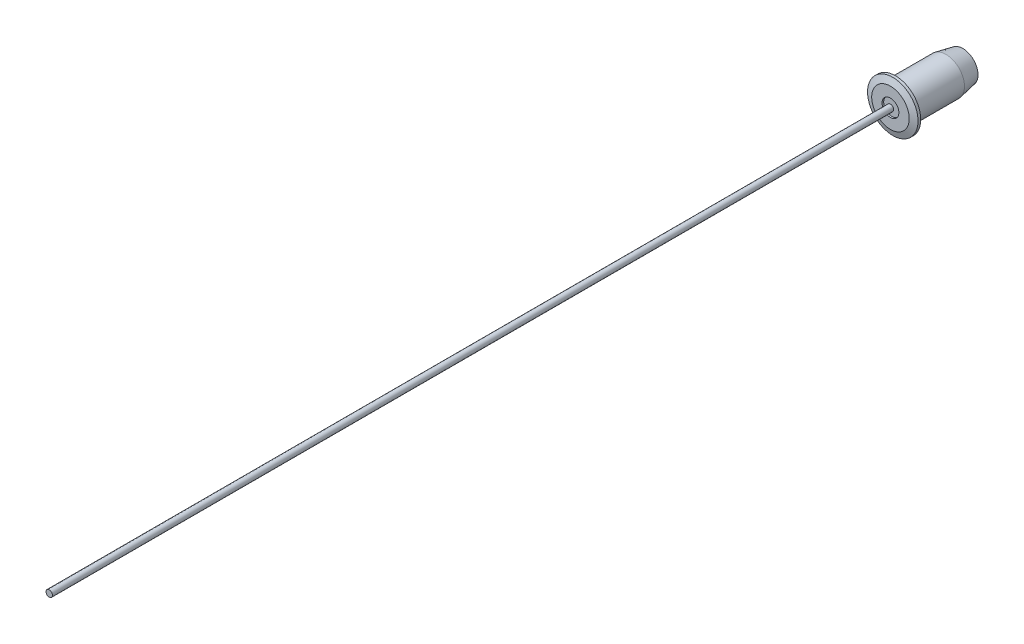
ISO-10303-21;
HEADER;
FILE_DESCRIPTION(('STEP AP214'),'2;1');
FILE_NAME('part.step','',(''),(''),'','','');
FILE_SCHEMA(('AUTOMOTIVE_DESIGN { 1 0 10303 214 1 1 1 1 }'));
ENDSEC;
DATA;
#1=APPLICATION_CONTEXT('core data for automotive mechanical design processes');
#2=APPLICATION_PROTOCOL_DEFINITION('international standard','automotive_design',2000,#1);
#3=PRODUCT_CONTEXT('',#1,'mechanical');
#4=PRODUCT('Part','Part','',(#3));
#5=PRODUCT_RELATED_PRODUCT_CATEGORY('part','',(#4));
#6=PRODUCT_DEFINITION_FORMATION('','',#4);
#7=PRODUCT_DEFINITION_CONTEXT('part definition',#1,'design');
#8=PRODUCT_DEFINITION('design','',#6,#7);
#9=PRODUCT_DEFINITION_SHAPE('','',#8);
#10=(LENGTH_UNIT() NAMED_UNIT(*) SI_UNIT(.MILLI.,.METRE.));
#11=(NAMED_UNIT(*) PLANE_ANGLE_UNIT() SI_UNIT($,.RADIAN.));
#12=(NAMED_UNIT(*) SI_UNIT($,.STERADIAN.) SOLID_ANGLE_UNIT());
#13=UNCERTAINTY_MEASURE_WITH_UNIT(LENGTH_MEASURE(1.E-05),#10,'distance_accuracy_value','');
#14=(GEOMETRIC_REPRESENTATION_CONTEXT(3) GLOBAL_UNCERTAINTY_ASSIGNED_CONTEXT((#13)) GLOBAL_UNIT_ASSIGNED_CONTEXT((#10,
#11,#12)) REPRESENTATION_CONTEXT('',''));
#15=CARTESIAN_POINT('',(0.,0.,0.));
#16=DIRECTION('',(0.,0.,1.));
#17=DIRECTION('',(1.,0.,0.));
#18=AXIS2_PLACEMENT_3D('',#15,#16,#17);
#19=CARTESIAN_POINT('',(0.,0.,251.5));
#20=DIRECTION('',(0.,0.,-1.));
#21=DIRECTION('',(-1.,0.,0.));
#22=AXIS2_PLACEMENT_3D('',#19,#20,#21);
#23=CYLINDRICAL_SURFACE('',#22,0.954691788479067);
#24=CARTESIAN_POINT('',(0.,0.,251.5));
#25=DIRECTION('',(0.,0.,1.));
#26=DIRECTION('',(1.,0.,0.));
#27=AXIS2_PLACEMENT_3D('',#24,#25,#26);
#28=CIRCLE('',#27,0.954691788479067);
#29=CARTESIAN_POINT('',(0.954691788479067,0.,251.5));
#30=VERTEX_POINT('',#29);
#31=EDGE_CURVE('E11',#30,#30,#28,.T.);
#32=ORIENTED_EDGE('',*,*,#31,.F.);
#33=EDGE_LOOP('',(#32));
#34=FACE_BOUND('',#33,.T.);
#35=CARTESIAN_POINT('',(0.,0.,1.5));
#36=DIRECTION('',(0.,0.,1.));
#37=DIRECTION('',(1.,0.,0.));
#38=AXIS2_PLACEMENT_3D('',#35,#36,#37);
#39=CIRCLE('',#38,0.954691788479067);
#40=CARTESIAN_POINT('',(0.954691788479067,0.,1.5));
#41=VERTEX_POINT('',#40);
#42=EDGE_CURVE('E44',#41,#41,#39,.T.);
#43=ORIENTED_EDGE('',*,*,#42,.T.);
#44=EDGE_LOOP('',(#43));
#45=FACE_BOUND('',#44,.T.);
#46=ADVANCED_FACE('F41',(#34,#45),#23,.T.);
#47=CARTESIAN_POINT('',(0.,0.,251.5));
#48=DIRECTION('',(0.,0.,1.));
#49=DIRECTION('',(1.,0.,0.));
#50=AXIS2_PLACEMENT_3D('',#47,#48,#49);
#51=PLANE('',#50);
#52=ORIENTED_EDGE('',*,*,#31,.T.);
#53=EDGE_LOOP('',(#52));
#54=FACE_BOUND('',#53,.T.);
#55=ADVANCED_FACE('F56',(#54),#51,.T.);
#56=CARTESIAN_POINT('',(0.,0.,1.5));
#57=DIRECTION('',(0.,0.,1.));
#58=DIRECTION('',(1.,0.,0.));
#59=AXIS2_PLACEMENT_3D('',#56,#57,#58);
#60=PLANE('',#59);
#61=ORIENTED_EDGE('',*,*,#42,.F.);
#62=EDGE_LOOP('',(#61));
#63=FACE_BOUND('',#62,.T.);
#64=ADVANCED_FACE('F54',(#63),#60,.F.);
#65=CLOSED_SHELL('',(#46,#55,#64));
#66=MANIFOLD_SOLID_BREP('B2_NOT_SHOWN',#65);
#67=CARTESIAN_POINT('',(0.,0.,1.5));
#68=DIRECTION('',(0.,0.,-1.));
#69=DIRECTION('',(-1.,0.,0.));
#70=AXIS2_PLACEMENT_3D('',#67,#68,#69);
#71=CYLINDRICAL_SURFACE('',#70,7.5);
#72=CARTESIAN_POINT('',(0.,0.,0.800000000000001));
#73=DIRECTION('',(0.,0.,1.));
#74=DIRECTION('',(1.,0.,0.));
#75=AXIS2_PLACEMENT_3D('',#72,#73,#74);
#76=CIRCLE('',#75,7.5);
#77=CARTESIAN_POINT('',(-7.5,0.,0.800000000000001));
#78=VERTEX_POINT('',#77);
#79=EDGE_CURVE('E96',#78,#78,#76,.F.);
#80=ORIENTED_EDGE('',*,*,#79,.T.);
#81=EDGE_LOOP('',(#80));
#82=FACE_BOUND('',#81,.T.);
#83=CARTESIAN_POINT('',(0.,0.,0.));
#84=DIRECTION('',(0.,0.,1.));
#85=DIRECTION('',(1.,0.,0.));
#86=AXIS2_PLACEMENT_3D('',#83,#84,#85);
#87=CIRCLE('',#86,7.5);
#88=CARTESIAN_POINT('',(7.5,0.,0.));
#89=VERTEX_POINT('',#88);
#90=EDGE_CURVE('E104',#89,#89,#87,.T.);
#91=ORIENTED_EDGE('',*,*,#90,.T.);
#92=EDGE_LOOP('',(#91));
#93=FACE_BOUND('',#92,.T.);
#94=ADVANCED_FACE('F81',(#82,#93),#71,.T.);
#95=CARTESIAN_POINT('',(0.,0.,1.5));
#96=DIRECTION('',(0.,0.,1.));
#97=DIRECTION('',(1.,0.,0.));
#98=AXIS2_PLACEMENT_3D('',#95,#96,#97);
#99=PLANE('',#98);
#100=CARTESIAN_POINT('',(0.,0.,1.5));
#101=DIRECTION('',(0.,0.,1.));
#102=DIRECTION('',(1.,0.,0.));
#103=AXIS2_PLACEMENT_3D('',#100,#101,#102);
#104=CIRCLE('',#103,2.5);
#105=CARTESIAN_POINT('',(2.5,0.,1.5));
#106=VERTEX_POINT('',#105);
#107=EDGE_CURVE('E108',#106,#106,#104,.T.);
#108=ORIENTED_EDGE('',*,*,#107,.F.);
#109=EDGE_LOOP('',(#108));
#110=FACE_BOUND('',#109,.T.);
#111=CARTESIAN_POINT('',(0.,0.,1.5));
#112=DIRECTION('',(0.,0.,1.));
#113=DIRECTION('',(1.,0.,0.));
#114=AXIS2_PLACEMENT_3D('',#111,#112,#113);
#115=CIRCLE('',#114,5.57676580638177);
#116=CARTESIAN_POINT('',(-5.57676580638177,0.,1.5));
#117=VERTEX_POINT('',#116);
#118=EDGE_CURVE('E101',#117,#117,#115,.T.);
#119=ORIENTED_EDGE('',*,*,#118,.T.);
#120=EDGE_LOOP('',(#119));
#121=FACE_BOUND('',#120,.T.);
#122=ADVANCED_FACE('F122',(#110,#121),#99,.T.);
#123=CARTESIAN_POINT('',(0.,0.,0.));
#124=DIRECTION('',(0.,0.,1.));
#125=DIRECTION('',(1.,0.,0.));
#126=AXIS2_PLACEMENT_3D('',#123,#124,#125);
#127=PLANE('',#126);
#128=CARTESIAN_POINT('',(0.,0.,0.));
#129=DIRECTION('',(0.,0.,1.));
#130=DIRECTION('',(1.,0.,0.));
#131=AXIS2_PLACEMENT_3D('',#128,#129,#130);
#132=CIRCLE('',#131,5.5);
#133=CARTESIAN_POINT('',(5.5,0.,0.));
#134=VERTEX_POINT('',#133);
#135=EDGE_CURVE('E92',#134,#134,#132,.F.);
#136=ORIENTED_EDGE('',*,*,#135,.F.);
#137=EDGE_LOOP('',(#136));
#138=FACE_BOUND('',#137,.T.);
#139=ORIENTED_EDGE('',*,*,#90,.F.);
#140=EDGE_LOOP('',(#139));
#141=FACE_BOUND('',#140,.T.);
#142=ADVANCED_FACE('F125',(#138,#141),#127,.F.);
#143=CARTESIAN_POINT('',(0.,0.,1.5));
#144=DIRECTION('',(0.,0.,-1.));
#145=DIRECTION('',(-1.,0.,0.));
#146=AXIS2_PLACEMENT_3D('',#143,#144,#145);
#147=CONICAL_SURFACE('',#146,5.57676580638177,1.22173047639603);
#148=CARTESIAN_POINT('',(-7.5,0.,0.800000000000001));
#149=CARTESIAN_POINT('',(-7.47996631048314,0.,0.807291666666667));
#150=CARTESIAN_POINT('',(-7.45993262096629,0.,0.814583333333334));
#151=CARTESIAN_POINT('',(-7.41986524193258,0.,0.829166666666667));
#152=CARTESIAN_POINT('',(-7.39983155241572,0.,0.836458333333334));
#153=CARTESIAN_POINT('',(-7.359764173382,0.,0.851041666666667));
#154=CARTESIAN_POINT('',(-7.33973048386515,0.,0.858333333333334));
#155=CARTESIAN_POINT('',(-7.29966310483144,0.,0.872916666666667));
#156=CARTESIAN_POINT('',(-7.27962941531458,0.,0.880208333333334));
#157=CARTESIAN_POINT('',(-7.23956203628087,0.,0.894791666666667));
#158=CARTESIAN_POINT('',(-7.21952834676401,0.,0.902083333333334));
#159=CARTESIAN_POINT('',(-7.1794609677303,0.,0.916666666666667));
#160=CARTESIAN_POINT('',(-7.15942727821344,0.,0.923958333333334));
#161=CARTESIAN_POINT('',(-7.11935989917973,0.,0.938541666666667));
#162=CARTESIAN_POINT('',(-7.09932620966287,0.,0.945833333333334));
#163=CARTESIAN_POINT('',(-7.05925883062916,0.,0.960416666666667));
#164=CARTESIAN_POINT('',(-7.0392251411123,0.,0.967708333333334));
#165=CARTESIAN_POINT('',(-6.99915776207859,0.,0.982291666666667));
#166=CARTESIAN_POINT('',(-6.97912407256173,0.,0.989583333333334));
#167=CARTESIAN_POINT('',(-6.93905669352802,0.,1.00416666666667));
#168=CARTESIAN_POINT('',(-6.91902300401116,0.,1.01145833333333));
#169=CARTESIAN_POINT('',(-6.87895562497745,0.,1.02604166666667));
#170=CARTESIAN_POINT('',(-6.85892193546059,0.,1.03333333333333));
#171=CARTESIAN_POINT('',(-6.81885455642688,0.,1.04791666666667));
#172=CARTESIAN_POINT('',(-6.79882086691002,0.,1.05520833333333));
#173=CARTESIAN_POINT('',(-6.75875348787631,0.,1.06979166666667));
#174=CARTESIAN_POINT('',(-6.73871979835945,0.,1.07708333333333));
#175=CARTESIAN_POINT('',(-6.69865241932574,0.,1.09166666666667));
#176=CARTESIAN_POINT('',(-6.67861872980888,0.,1.09895833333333));
#177=CARTESIAN_POINT('',(-6.63855135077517,0.,1.11354166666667));
#178=CARTESIAN_POINT('',(-6.61851766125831,0.,1.12083333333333));
#179=CARTESIAN_POINT('',(-6.5784502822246,0.,1.13541666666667));
#180=CARTESIAN_POINT('',(-6.55841659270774,0.,1.14270833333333));
#181=CARTESIAN_POINT('',(-6.51834921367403,0.,1.15729166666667));
#182=CARTESIAN_POINT('',(-6.49831552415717,0.,1.16458333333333));
#183=CARTESIAN_POINT('',(-6.45824814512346,0.,1.17916666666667));
#184=CARTESIAN_POINT('',(-6.43821445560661,0.,1.18645833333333));
#185=CARTESIAN_POINT('',(-6.39814707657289,0.,1.20104166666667));
#186=CARTESIAN_POINT('',(-6.37811338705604,0.,1.20833333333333));
#187=CARTESIAN_POINT('',(-6.33804600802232,0.,1.22291666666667));
#188=CARTESIAN_POINT('',(-6.31801231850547,0.,1.23020833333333));
#189=CARTESIAN_POINT('',(-6.27794493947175,0.,1.24479166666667));
#190=CARTESIAN_POINT('',(-6.2579112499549,0.,1.25208333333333));
#191=CARTESIAN_POINT('',(-6.21784387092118,0.,1.26666666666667));
#192=CARTESIAN_POINT('',(-6.19781018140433,0.,1.27395833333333));
#193=CARTESIAN_POINT('',(-6.15774280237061,0.,1.28854166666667));
#194=CARTESIAN_POINT('',(-6.13770911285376,0.,1.29583333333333));
#195=CARTESIAN_POINT('',(-6.09764173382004,0.,1.31041666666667));
#196=CARTESIAN_POINT('',(-6.07760804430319,0.,1.31770833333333));
#197=CARTESIAN_POINT('',(-6.03754066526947,0.,1.33229166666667));
#198=CARTESIAN_POINT('',(-6.01750697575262,0.,1.33958333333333));
#199=CARTESIAN_POINT('',(-5.9774395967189,0.,1.35416666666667));
#200=CARTESIAN_POINT('',(-5.95740590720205,0.,1.36145833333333));
#201=CARTESIAN_POINT('',(-5.91733852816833,0.,1.37604166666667));
#202=CARTESIAN_POINT('',(-5.89730483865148,0.,1.38333333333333));
#203=CARTESIAN_POINT('',(-5.85723745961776,0.,1.39791666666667));
#204=CARTESIAN_POINT('',(-5.83720377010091,0.,1.40520833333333));
#205=CARTESIAN_POINT('',(-5.79713639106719,0.,1.41979166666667));
#206=CARTESIAN_POINT('',(-5.77710270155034,0.,1.42708333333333));
#207=CARTESIAN_POINT('',(-5.73703532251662,0.,1.44166666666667));
#208=CARTESIAN_POINT('',(-5.71700163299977,0.,1.44895833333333));
#209=CARTESIAN_POINT('',(-5.67693425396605,0.,1.46354166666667));
#210=CARTESIAN_POINT('',(-5.6569005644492,0.,1.47083333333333));
#211=CARTESIAN_POINT('',(-5.61683318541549,0.,1.48541666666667));
#212=CARTESIAN_POINT('',(-5.59679949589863,0.,1.49270833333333));
#213=CARTESIAN_POINT('',(-5.57676580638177,0.,1.5));
#214=B_SPLINE_CURVE_WITH_KNOTS('',3,(#148,#149,#150,#151,#152,#153,#154,#155,#156,#157,#158,
#159,#160,#161,#162,#163,#164,#165,#166,#167,#168,#169,#170,#171,#172,#173,#174,#175,#176,#177,
#178,#179,#180,#181,#182,#183,#184,#185,#186,#187,#188,#189,#190,#191,#192,#193,#194,#195,#196,
#197,#198,#199,#200,#201,#202,#203,#204,#205,#206,#207,#208,#209,#210,#211,#212,#213),
.UNSPECIFIED.,.F.,.F.,(4,2,2,2,2,2,2,2,2,2,2,2,2,2,2,2,2,2,2,2,2,2,2,2,2,2,2,2,2,2,2,2,4),(0.,
0.0639582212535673,0.127916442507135,0.191874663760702,0.255832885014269,0.319791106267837,
0.383749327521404,0.447707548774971,0.511665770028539,0.575623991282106,0.639582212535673,
0.703540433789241,0.767498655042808,0.831456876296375,0.895415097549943,0.95937331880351,
1.02333154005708,1.08728976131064,1.15124798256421,1.21520620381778,1.27916442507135,
1.34312264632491,1.40708086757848,1.47103908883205,1.53499731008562,1.59895553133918,
1.66291375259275,1.72687197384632,1.79083019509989,1.85478841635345,1.91874663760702,
1.98270485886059,2.04666308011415),.UNSPECIFIED.);
#215=EDGE_CURVE('BSEAM129',#78,#117,#214,.T.);
#216=ORIENTED_EDGE('',*,*,#79,.F.);
#217=ORIENTED_EDGE('',*,*,#118,.F.);
#218=ORIENTED_EDGE('',*,*,#215,.T.);
#219=ORIENTED_EDGE('',*,*,#215,.F.);
#220=EDGE_LOOP('',(#216,#218,#217,#219));
#221=FACE_BOUND('',#220,.T.);
#222=ADVANCED_FACE('F129',(#221),#147,.T.);
#223=CARTESIAN_POINT('',(0.,0.,-20.));
#224=DIRECTION('',(0.,0.,1.));
#225=DIRECTION('',(1.,0.,0.));
#226=AXIS2_PLACEMENT_3D('',#223,#224,#225);
#227=CYLINDRICAL_SURFACE('',#226,5.5);
#228=CARTESIAN_POINT('',(0.,0.,-14.9999999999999));
#229=DIRECTION('',(0.,0.,-1.));
#230=DIRECTION('',(-1.,0.,0.));
#231=AXIS2_PLACEMENT_3D('',#228,#229,#230);
#232=CIRCLE('',#231,5.5);
#233=CARTESIAN_POINT('',(-5.5,0.,-14.9999999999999));
#234=VERTEX_POINT('',#233);
#235=EDGE_CURVE('E40',#234,#234,#232,.F.);
#236=ORIENTED_EDGE('',*,*,#235,.T.);
#237=EDGE_LOOP('',(#236));
#238=FACE_BOUND('',#237,.T.);
#239=ORIENTED_EDGE('',*,*,#135,.T.);
#240=EDGE_LOOP('',(#239));
#241=FACE_BOUND('',#240,.T.);
#242=ADVANCED_FACE('F131',(#238,#241),#227,.T.);
#243=CARTESIAN_POINT('',(0.,0.,-20.));
#244=DIRECTION('',(0.,0.,-1.));
#245=DIRECTION('',(-1.,0.,0.));
#246=AXIS2_PLACEMENT_3D('',#243,#244,#245);
#247=PLANE('',#246);
#248=CARTESIAN_POINT('',(0.,0.,-20.));
#249=DIRECTION('',(0.,0.,-1.));
#250=DIRECTION('',(-1.,0.,0.));
#251=AXIS2_PLACEMENT_3D('',#248,#249,#250);
#252=CIRCLE('',#251,4.5280984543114);
#253=CARTESIAN_POINT('',(-4.5280984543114,0.,-20.));
#254=VERTEX_POINT('',#253);
#255=EDGE_CURVE('E88',#254,#254,#252,.T.);
#256=ORIENTED_EDGE('',*,*,#255,.T.);
#257=EDGE_LOOP('',(#256));
#258=FACE_BOUND('',#257,.T.);
#259=ADVANCED_FACE('F137',(#258),#247,.T.);
#260=CARTESIAN_POINT('',(0.,0.,-20.));
#261=DIRECTION('',(0.,0.,1.));
#262=DIRECTION('',(1.,0.,0.));
#263=AXIS2_PLACEMENT_3D('',#260,#261,#262);
#264=CONICAL_SURFACE('',#263,4.5280984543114,0.191986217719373);
#265=ORIENTED_EDGE('',*,*,#235,.F.);
#266=EDGE_LOOP('',(#265));
#267=FACE_BOUND('',#266,.T.);
#268=ORIENTED_EDGE('',*,*,#255,.F.);
#269=EDGE_LOOP('',(#268));
#270=FACE_BOUND('',#269,.T.);
#271=ADVANCED_FACE('F83',(#267,#270),#264,.T.);
#272=CARTESIAN_POINT('',(0.,0.,1.));
#273=DIRECTION('',(0.,0.,1.));
#274=DIRECTION('',(1.,0.,0.));
#275=AXIS2_PLACEMENT_3D('',#272,#273,#274);
#276=CYLINDRICAL_SURFACE('',#275,2.5);
#277=CARTESIAN_POINT('',(0.,0.,1.));
#278=DIRECTION('',(0.,0.,1.));
#279=DIRECTION('',(1.,0.,0.));
#280=AXIS2_PLACEMENT_3D('',#277,#278,#279);
#281=CIRCLE('',#280,2.5);
#282=CARTESIAN_POINT('',(2.5,0.,1.));
#283=VERTEX_POINT('',#282);
#284=EDGE_CURVE('E107',#283,#283,#281,.T.);
#285=ORIENTED_EDGE('',*,*,#284,.F.);
#286=EDGE_LOOP('',(#285));
#287=FACE_BOUND('',#286,.T.);
#288=ORIENTED_EDGE('',*,*,#107,.T.);
#289=EDGE_LOOP('',(#288));
#290=FACE_BOUND('',#289,.T.);
#291=ADVANCED_FACE('F116',(#287,#290),#276,.F.);
#292=CARTESIAN_POINT('',(0.,0.,1.));
#293=DIRECTION('',(0.,0.,1.));
#294=DIRECTION('',(1.,0.,0.));
#295=AXIS2_PLACEMENT_3D('',#292,#293,#294);
#296=PLANE('',#295);
#297=ORIENTED_EDGE('',*,*,#284,.T.);
#298=EDGE_LOOP('',(#297));
#299=FACE_BOUND('',#298,.T.);
#300=ADVANCED_FACE('F114',(#299),#296,.T.);
#301=CLOSED_SHELL('',(#94,#122,#142,#222,#242,#259,#271,#291,#300));
#302=MANIFOLD_SOLID_BREP('B6',#301);
#303=ADVANCED_BREP_SHAPE_REPRESENTATION('',(#18,#66,#302),#14);
#304=SHAPE_DEFINITION_REPRESENTATION(#9,#303);
ENDSEC;
END-ISO-10303-21;
